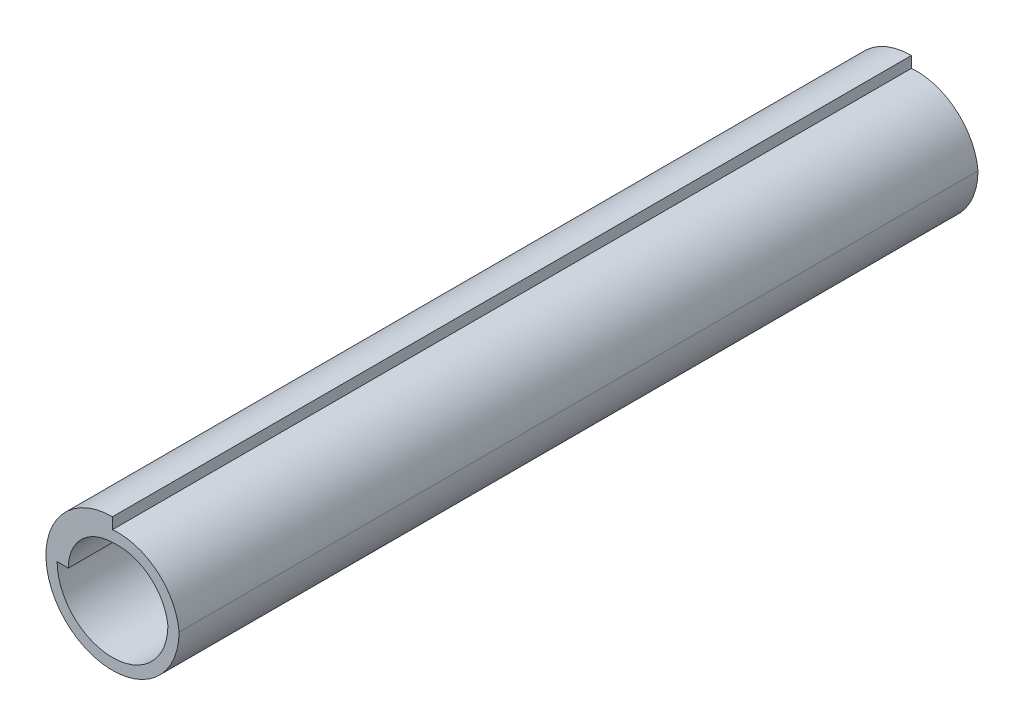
from build123d import *

# Parameters (mm, degrees)
BASE_EXTRUDE_DEPTH = 15


with BuildPart() as part:
    # Sketch1 → Base-Extrude (new, symmetric)
    with BuildSketch(Plane.XY):
        with BuildLine():
            Line((0, 2.08), (0, 2.5))
            ThreePointArc((0, 2.5), (-1.767766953, -1.767766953), (2.5, 0))
            ThreePointArc((2.5, 0), (1.680782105, 1.557766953), (0, 2.08))
        make_face()
        with BuildLine():
            Line((-2.08, 0), (-1.66, 0))
            ThreePointArc((-1.66, 0), (-1.173797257, 1.173797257), (0, 1.66))
            ThreePointArc((0, 1.66), (1.383797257, 1.260782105), (2.08, 0))
            ThreePointArc((2.08, 0), (0, -2.08), (-2.08, 0))
        make_face(mode=Mode.SUBTRACT)
    extrude(amount=BASE_EXTRUDE_DEPTH, both=True)


solid = part.part
